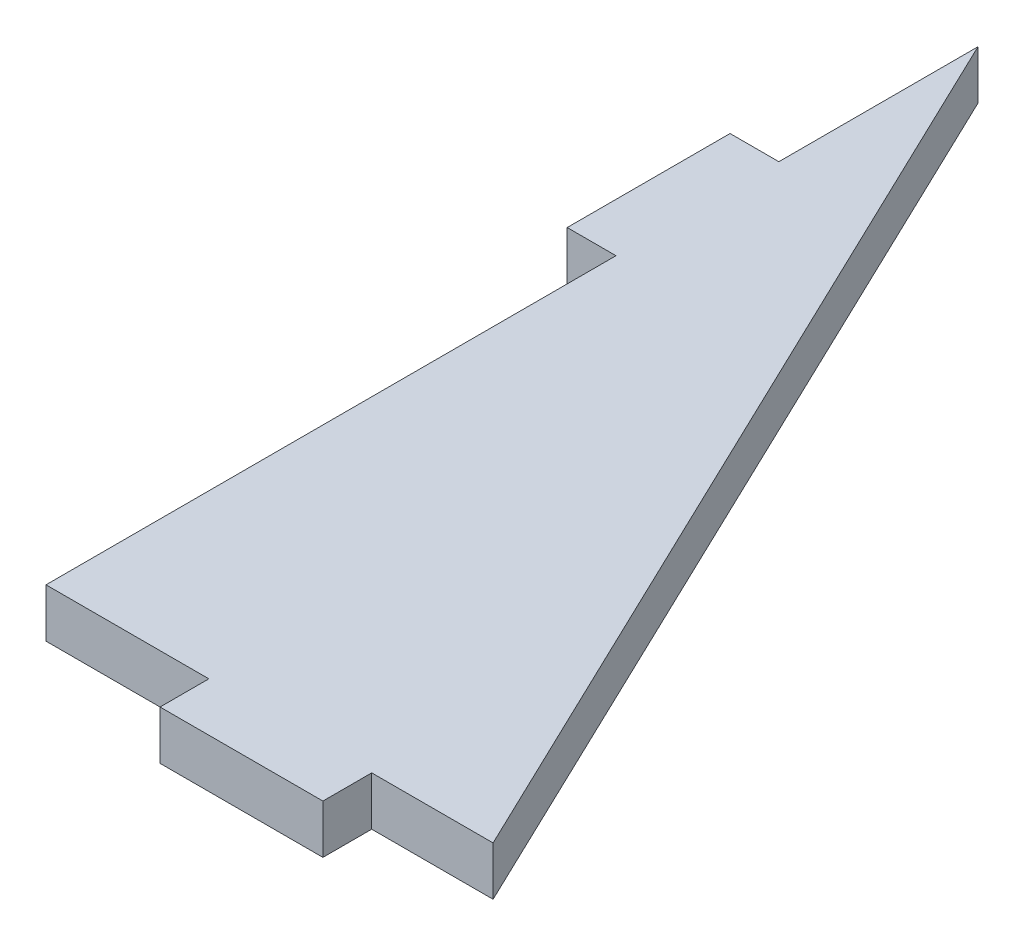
from build123d import *

# Parameters (mm, degrees)
SKETCH1_W           = 10
SKETCH1_H           = 2.9972
SKETCH1_W_2         = 2.9972
SKETCH1_H_2         = 10
BOSS_EXTRUDE1_DEPTH = 2.9972


with BuildPart() as part:
    # Sketch1 → Boss-Extrude1 (new body)
    with BuildSketch(Plane(origin=(0, 0, 0), x_dir=(1, 0, 0), z_dir=(0, 1, 0))):
        Polygon((27.451884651, 0), (0, 0), (0, 57.227607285), align=None)
        with Locations((15, -1.4986)):
            Rectangle(SKETCH1_W, SKETCH1_H)
        with Locations((-1.4986, 40)):
            Rectangle(SKETCH1_W_2, SKETCH1_H_2)
    extrude(amount=BOSS_EXTRUDE1_DEPTH)


solid = part.part
